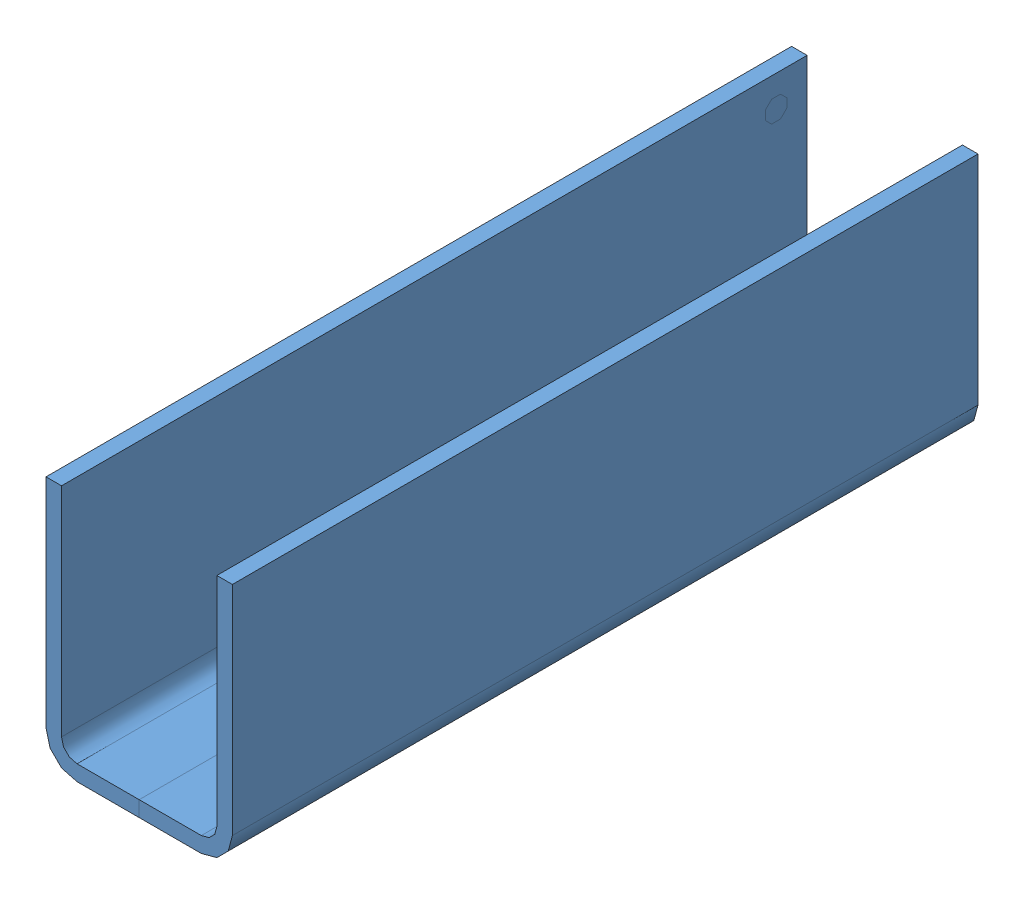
SolidWorks assembly Channel Assy.SLDASM, configuration Default (file format 3400). Lengths in mm.
Overall size (152.4 203.2 609.6).
2 component instances, 2 part files, 0 mates.
Components (placement in the parent):
- Channel-1: Channel.SLDPRT [Default] at origin size (152.4 203.2 609.6)
- Dowel-1: Dowel.SLDPRT [Default] at (63.5 177.8 25.4) x (0 0 1) z (-1 0 0) (suppressed, hidden)
